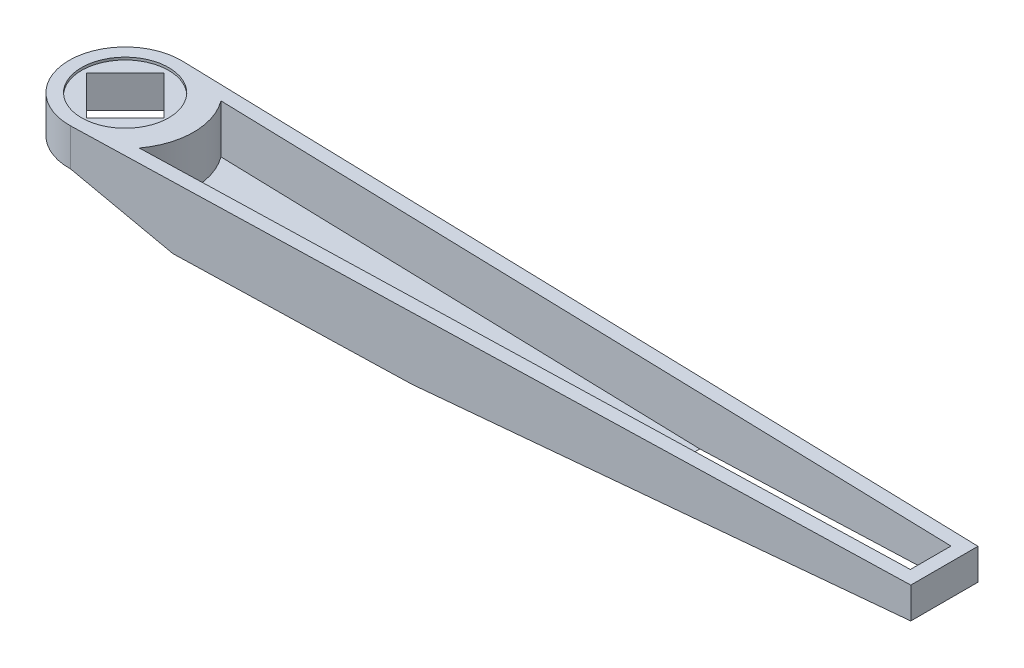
ISO-10303-21;
HEADER;
FILE_DESCRIPTION(('STEP AP214'),'2;1');
FILE_NAME('part.step','',(''),(''),'','','');
FILE_SCHEMA(('AUTOMOTIVE_DESIGN { 1 0 10303 214 1 1 1 1 }'));
ENDSEC;
DATA;
#1=APPLICATION_CONTEXT('core data for automotive mechanical design processes');
#2=APPLICATION_PROTOCOL_DEFINITION('international standard','automotive_design',2000,#1);
#3=PRODUCT_CONTEXT('',#1,'mechanical');
#4=PRODUCT('Part','Part','',(#3));
#5=PRODUCT_RELATED_PRODUCT_CATEGORY('part','',(#4));
#6=PRODUCT_DEFINITION_FORMATION('','',#4);
#7=PRODUCT_DEFINITION_CONTEXT('part definition',#1,'design');
#8=PRODUCT_DEFINITION('design','',#6,#7);
#9=PRODUCT_DEFINITION_SHAPE('','',#8);
#10=(LENGTH_UNIT() NAMED_UNIT(*) SI_UNIT(.MILLI.,.METRE.));
#11=(NAMED_UNIT(*) PLANE_ANGLE_UNIT() SI_UNIT($,.RADIAN.));
#12=(NAMED_UNIT(*) SI_UNIT($,.STERADIAN.) SOLID_ANGLE_UNIT());
#13=UNCERTAINTY_MEASURE_WITH_UNIT(LENGTH_MEASURE(1.E-05),#10,'distance_accuracy_value','');
#14=(GEOMETRIC_REPRESENTATION_CONTEXT(3) GLOBAL_UNCERTAINTY_ASSIGNED_CONTEXT((#13)) GLOBAL_UNIT_ASSIGNED_CONTEXT((#10,
#11,#12)) REPRESENTATION_CONTEXT('',''));
#15=CARTESIAN_POINT('',(0.,0.,0.));
#16=DIRECTION('',(0.,0.,1.));
#17=DIRECTION('',(1.,0.,0.));
#18=AXIS2_PLACEMENT_3D('',#15,#16,#17);
#19=CARTESIAN_POINT('',(15.556349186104,0.,0.));
#20=DIRECTION('',(0.707106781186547,0.,-0.707106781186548));
#21=DIRECTION('',(-0.707106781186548,0.,-0.707106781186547));
#22=AXIS2_PLACEMENT_3D('',#19,#20,#21);
#23=PLANE('',#22);
#24=DIRECTION('',(-0.707106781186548,0.,-0.707106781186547));
#25=VECTOR('',#24,1.);
#26=CARTESIAN_POINT('',(15.556349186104,11.,0.));
#27=LINE('',#26,#25);
#28=CARTESIAN_POINT('',(15.556349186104,11.,0.));
#29=VERTEX_POINT('',#28);
#30=CARTESIAN_POINT('',(0.,11.,-15.556349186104));
#31=VERTEX_POINT('',#30);
#32=EDGE_CURVE('E249',#29,#31,#27,.T.);
#33=ORIENTED_EDGE('',*,*,#32,.F.);
#34=DIRECTION('',(0.,1.,0.));
#35=VECTOR('',#34,1.);
#36=CARTESIAN_POINT('',(15.556349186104,0.,0.));
#37=LINE('',#36,#35);
#38=CARTESIAN_POINT('',(15.556349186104,24.,0.));
#39=VERTEX_POINT('',#38);
#40=EDGE_CURVE('E256',#29,#39,#37,.T.);
#41=ORIENTED_EDGE('',*,*,#40,.T.);
#42=DIRECTION('',(-0.707106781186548,0.,-0.707106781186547));
#43=VECTOR('',#42,1.);
#44=CARTESIAN_POINT('',(7.77817459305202,24.,-7.77817459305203));
#45=LINE('',#44,#43);
#46=CARTESIAN_POINT('',(0.,24.,-15.556349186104));
#47=VERTEX_POINT('',#46);
#48=EDGE_CURVE('E344',#39,#47,#45,.T.);
#49=ORIENTED_EDGE('',*,*,#48,.T.);
#50=DIRECTION('',(0.,1.,0.));
#51=VECTOR('',#50,1.);
#52=CARTESIAN_POINT('',(0.,0.,-15.556349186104));
#53=LINE('',#52,#51);
#54=EDGE_CURVE('E251',#31,#47,#53,.T.);
#55=ORIENTED_EDGE('',*,*,#54,.F.);
#56=EDGE_LOOP('',(#33,#41,#49,#55));
#57=FACE_BOUND('',#56,.T.);
#58=ADVANCED_FACE('F61',(#57),#23,.F.);
#59=CARTESIAN_POINT('',(0.,0.,15.556349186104));
#60=DIRECTION('',(0.707106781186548,0.,0.707106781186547));
#61=DIRECTION('',(0.707106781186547,0.,-0.707106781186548));
#62=AXIS2_PLACEMENT_3D('',#59,#60,#61);
#63=PLANE('',#62);
#64=DIRECTION('',(0.707106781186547,0.,-0.707106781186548));
#65=VECTOR('',#64,1.);
#66=CARTESIAN_POINT('',(0.,11.,15.556349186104));
#67=LINE('',#66,#65);
#68=CARTESIAN_POINT('',(0.,11.,15.556349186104));
#69=VERTEX_POINT('',#68);
#70=EDGE_CURVE('E247',#69,#29,#67,.T.);
#71=ORIENTED_EDGE('',*,*,#70,.F.);
#72=DIRECTION('',(0.,1.,0.));
#73=VECTOR('',#72,1.);
#74=CARTESIAN_POINT('',(0.,0.,15.556349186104));
#75=LINE('',#74,#73);
#76=CARTESIAN_POINT('',(0.,24.,15.556349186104));
#77=VERTEX_POINT('',#76);
#78=EDGE_CURVE('E257',#69,#77,#75,.T.);
#79=ORIENTED_EDGE('',*,*,#78,.T.);
#80=DIRECTION('',(0.707106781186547,0.,-0.707106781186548));
#81=VECTOR('',#80,1.);
#82=CARTESIAN_POINT('',(7.77817459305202,24.,7.77817459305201));
#83=LINE('',#82,#81);
#84=EDGE_CURVE('E341',#77,#39,#83,.T.);
#85=ORIENTED_EDGE('',*,*,#84,.T.);
#86=ORIENTED_EDGE('',*,*,#40,.F.);
#87=EDGE_LOOP('',(#71,#79,#85,#86));
#88=FACE_BOUND('',#87,.T.);
#89=ADVANCED_FACE('F371',(#88),#63,.F.);
#90=CARTESIAN_POINT('',(-15.556349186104,0.,0.));
#91=DIRECTION('',(-0.707106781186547,0.,0.707106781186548));
#92=DIRECTION('',(0.707106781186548,0.,0.707106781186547));
#93=AXIS2_PLACEMENT_3D('',#90,#91,#92);
#94=PLANE('',#93);
#95=DIRECTION('',(0.707106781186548,0.,0.707106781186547));
#96=VECTOR('',#95,1.);
#97=CARTESIAN_POINT('',(-15.556349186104,11.,0.));
#98=LINE('',#97,#96);
#99=CARTESIAN_POINT('',(-15.556349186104,11.,0.));
#100=VERTEX_POINT('',#99);
#101=EDGE_CURVE('E245',#100,#69,#98,.T.);
#102=ORIENTED_EDGE('',*,*,#101,.F.);
#103=DIRECTION('',(0.,1.,0.));
#104=VECTOR('',#103,1.);
#105=CARTESIAN_POINT('',(-15.556349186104,0.,0.));
#106=LINE('',#105,#104);
#107=CARTESIAN_POINT('',(-15.556349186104,24.,0.));
#108=VERTEX_POINT('',#107);
#109=EDGE_CURVE('E259',#100,#108,#106,.T.);
#110=ORIENTED_EDGE('',*,*,#109,.T.);
#111=DIRECTION('',(0.707106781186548,0.,0.707106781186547));
#112=VECTOR('',#111,1.);
#113=CARTESIAN_POINT('',(-7.77817459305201,24.,7.77817459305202));
#114=LINE('',#113,#112);
#115=EDGE_CURVE('E338',#108,#77,#114,.T.);
#116=ORIENTED_EDGE('',*,*,#115,.T.);
#117=ORIENTED_EDGE('',*,*,#78,.F.);
#118=EDGE_LOOP('',(#102,#110,#116,#117));
#119=FACE_BOUND('',#118,.T.);
#120=ADVANCED_FACE('F378',(#119),#94,.F.);
#121=CARTESIAN_POINT('',(0.,0.,-15.556349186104));
#122=DIRECTION('',(-0.707106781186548,0.,-0.707106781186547));
#123=DIRECTION('',(-0.707106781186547,0.,0.707106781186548));
#124=AXIS2_PLACEMENT_3D('',#121,#122,#123);
#125=PLANE('',#124);
#126=DIRECTION('',(-0.707106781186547,0.,0.707106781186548));
#127=VECTOR('',#126,1.);
#128=CARTESIAN_POINT('',(0.,11.,-15.556349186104));
#129=LINE('',#128,#127);
#130=EDGE_CURVE('E347',#31,#100,#129,.T.);
#131=ORIENTED_EDGE('',*,*,#130,.F.);
#132=ORIENTED_EDGE('',*,*,#54,.T.);
#133=DIRECTION('',(-0.707106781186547,0.,0.707106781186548));
#134=VECTOR('',#133,1.);
#135=CARTESIAN_POINT('',(-7.77817459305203,24.,-7.77817459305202));
#136=LINE('',#135,#134);
#137=EDGE_CURVE('E334',#47,#108,#136,.T.);
#138=ORIENTED_EDGE('',*,*,#137,.T.);
#139=ORIENTED_EDGE('',*,*,#109,.F.);
#140=EDGE_LOOP('',(#131,#132,#138,#139));
#141=FACE_BOUND('',#140,.T.);
#142=ADVANCED_FACE('F521',(#141),#125,.F.);
#143=CARTESIAN_POINT('',(0.615847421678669,25.,-22.4915702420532));
#144=DIRECTION('',(1.,0.,0.));
#145=DIRECTION('',(0.,0.,-1.));
#146=AXIS2_PLACEMENT_3D('',#143,#144,#145);
#147=PLANE('',#146);
#148=DIRECTION('',(0.,0.00684258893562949,0.999976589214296));
#149=VECTOR('',#148,1.);
#150=CARTESIAN_POINT('',(0.615847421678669,9.69290838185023,-22.3868276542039));
#151=LINE('',#150,#149);
#152=CARTESIAN_POINT('',(0.615847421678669,9.69219165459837,-22.4915702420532));
#153=VERTEX_POINT('',#152);
#154=CARTESIAN_POINT('',(0.615847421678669,9.74386172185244,-14.9405017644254));
#155=VERTEX_POINT('',#154);
#156=EDGE_CURVE('E327',#153,#155,#151,.T.);
#157=ORIENTED_EDGE('',*,*,#156,.T.);
#158=DIRECTION('',(0.,1.,0.));
#159=VECTOR('',#158,1.);
#160=CARTESIAN_POINT('',(0.615847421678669,25.,-14.9405017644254));
#161=LINE('',#160,#159);
#162=CARTESIAN_POINT('',(0.61584742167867,10.,-14.9405017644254));
#163=VERTEX_POINT('',#162);
#164=EDGE_CURVE('E267',#155,#163,#161,.T.);
#165=ORIENTED_EDGE('',*,*,#164,.T.);
#166=DIRECTION('',(0.,0.,-1.));
#167=VECTOR('',#166,1.);
#168=CARTESIAN_POINT('',(0.615847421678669,10.,-22.4915702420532));
#169=LINE('',#168,#167);
#170=CARTESIAN_POINT('',(0.615847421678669,10.,-17.4891604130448));
#171=VERTEX_POINT('',#170);
#172=EDGE_CURVE('E240',#163,#171,#169,.T.);
#173=ORIENTED_EDGE('',*,*,#172,.T.);
#174=DIRECTION('',(0.,0.,1.));
#175=VECTOR('',#174,1.);
#176=CARTESIAN_POINT('',(0.615847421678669,10.,-22.4915702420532));
#177=LINE('',#176,#175);
#178=CARTESIAN_POINT('',(0.615847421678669,10.,-22.4915702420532));
#179=VERTEX_POINT('',#178);
#180=EDGE_CURVE('E331',#179,#171,#177,.T.);
#181=ORIENTED_EDGE('',*,*,#180,.F.);
#182=DIRECTION('',(0.,-1.,0.));
#183=VECTOR('',#182,1.);
#184=CARTESIAN_POINT('',(0.615847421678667,25.,-22.4915702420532));
#185=LINE('',#184,#183);
#186=EDGE_CURVE('E318',#179,#153,#185,.T.);
#187=ORIENTED_EDGE('',*,*,#186,.T.);
#188=EDGE_LOOP('',(#157,#165,#173,#181,#187));
#189=FACE_BOUND('',#188,.T.);
#190=ADVANCED_FACE('F419',(#189),#147,.F.);
#191=CARTESIAN_POINT('',(0.615847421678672,10.,14.9405017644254));
#192=VERTEX_POINT('',#191);
#193=CARTESIAN_POINT('',(0.615847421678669,10.,17.4891604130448));
#194=VERTEX_POINT('',#193);
#195=EDGE_CURVE('E335',#192,#194,#177,.T.);
#196=ORIENTED_EDGE('',*,*,#195,.F.);
#197=DIRECTION('',(0.,-1.,0.));
#198=VECTOR('',#197,1.);
#199=CARTESIAN_POINT('',(0.615847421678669,25.,14.9405017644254));
#200=LINE('',#199,#198);
#201=CARTESIAN_POINT('',(0.615847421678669,9.94832993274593,14.9405017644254));
#202=VERTEX_POINT('',#201);
#203=EDGE_CURVE('E255',#192,#202,#200,.T.);
#204=ORIENTED_EDGE('',*,*,#203,.T.);
#205=CARTESIAN_POINT('',(0.615847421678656,10.,22.4915702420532));
#206=VERTEX_POINT('',#205);
#207=EDGE_CURVE('E326',#202,#206,#151,.T.);
#208=ORIENTED_EDGE('',*,*,#207,.T.);
#209=EDGE_CURVE('E330',#194,#206,#177,.T.);
#210=ORIENTED_EDGE('',*,*,#209,.F.);
#211=EDGE_LOOP('',(#196,#204,#208,#210));
#212=FACE_BOUND('',#211,.T.);
#213=ADVANCED_FACE('F63',(#212),#147,.F.);
#214=CARTESIAN_POINT('',(-122.525664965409,0.,0.));
#215=DIRECTION('',(0.,1.,0.));
#216=DIRECTION('',(0.,0.,1.));
#217=AXIS2_PLACEMENT_3D('',#214,#215,#216);
#218=PLANE('',#217);
#219=DIRECTION('',(0.999625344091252,0.,-0.027370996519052));
#220=VECTOR('',#219,1.);
#221=CARTESIAN_POINT('',(-121.818024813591,0.,25.8439633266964));
#222=LINE('',#221,#220);
#223=CARTESIAN_POINT('',(40.6008611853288,0.,21.3967303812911));
#224=VERTEX_POINT('',#223);
#225=CARTESIAN_POINT('',(134.,0.,18.8393447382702));
#226=VERTEX_POINT('',#225);
#227=EDGE_CURVE('E305',#224,#226,#222,.T.);
#228=ORIENTED_EDGE('',*,*,#227,.F.);
#229=DIRECTION('',(-0.027370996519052,0.,-0.999625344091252));
#230=VECTOR('',#229,1.);
#231=CARTESIAN_POINT('',(53.2618925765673,0.,483.794504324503));
#232=LINE('',#231,#230);
#233=CARTESIAN_POINT('',(39.4282433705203,0.,-21.4288381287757));
#234=VERTEX_POINT('',#233);
#235=EDGE_CURVE('E283',#224,#234,#232,.T.);
#236=ORIENTED_EDGE('',*,*,#235,.T.);
#237=DIRECTION('',(0.999625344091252,0.,0.027370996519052));
#238=VECTOR('',#237,1.);
#239=CARTESIAN_POINT('',(-121.818024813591,0.,-25.8439633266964));
#240=LINE('',#239,#238);
#241=CARTESIAN_POINT('',(134.,0.,-18.8393447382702));
#242=VERTEX_POINT('',#241);
#243=EDGE_CURVE('E300',#234,#242,#240,.T.);
#244=ORIENTED_EDGE('',*,*,#243,.T.);
#245=DIRECTION('',(0.,0.,1.));
#246=VECTOR('',#245,1.);
#247=CARTESIAN_POINT('',(134.,0.,-22.4915702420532));
#248=LINE('',#247,#246);
#249=EDGE_CURVE('E293',#242,#226,#248,.T.);
#250=ORIENTED_EDGE('',*,*,#249,.T.);
#251=EDGE_LOOP('',(#228,#236,#244,#250));
#252=FACE_BOUND('',#251,.T.);
#253=ADVANCED_FACE('F428',(#252),#218,.F.);
#254=CARTESIAN_POINT('',(-121.818024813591,25.,25.8439633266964));
#255=DIRECTION('',(-0.027370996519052,0.,-0.999625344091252));
#256=DIRECTION('',(-0.999625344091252,0.,0.027370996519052));
#257=AXIS2_PLACEMENT_3D('',#254,#255,#256);
#258=PLANE('',#257);
#259=DIRECTION('',(0.,-1.,0.));
#260=VECTOR('',#259,1.);
#261=CARTESIAN_POINT('',(0.615847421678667,25.,22.4915702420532));
#262=LINE('',#261,#260);
#263=CARTESIAN_POINT('',(0.615847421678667,25.,22.4915702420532));
#264=VERTEX_POINT('',#263);
#265=EDGE_CURVE('E315',#264,#206,#262,.T.);
#266=ORIENTED_EDGE('',*,*,#265,.T.);
#267=DIRECTION('',(0.969779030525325,-0.242535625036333,-0.0265537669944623));
#268=VECTOR('',#267,1.);
#269=CARTESIAN_POINT('',(-118.144121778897,39.7011200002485,25.7433672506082));
#270=LINE('',#269,#268);
#271=EDGE_CURVE('E289',#206,#224,#270,.T.);
#272=ORIENTED_EDGE('',*,*,#271,.T.);
#273=ORIENTED_EDGE('',*,*,#227,.T.);
#274=DIRECTION('',(0.997579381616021,0.0639473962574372,-0.027314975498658));
#275=VECTOR('',#274,1.);
#276=CARTESIAN_POINT('',(-119.177100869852,-16.229301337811,25.7716515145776));
#277=LINE('',#276,#275);
#278=CARTESIAN_POINT('',(329.,12.5,13.5));
#279=VERTEX_POINT('',#278);
#280=EDGE_CURVE('E296',#226,#279,#277,.T.);
#281=ORIENTED_EDGE('',*,*,#280,.T.);
#282=DIRECTION('',(0.,-1.,0.));
#283=VECTOR('',#282,1.);
#284=CARTESIAN_POINT('',(329.,25.,13.5));
#285=LINE('',#284,#283);
#286=CARTESIAN_POINT('',(329.,25.,13.5));
#287=VERTEX_POINT('',#286);
#288=EDGE_CURVE('E310',#287,#279,#285,.T.);
#289=ORIENTED_EDGE('',*,*,#288,.F.);
#290=DIRECTION('',(0.999625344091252,0.,-0.027370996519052));
#291=VECTOR('',#290,1.);
#292=CARTESIAN_POINT('',(-121.818024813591,25.,25.8439633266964));
#293=LINE('',#292,#291);
#294=EDGE_CURVE('E308',#264,#287,#293,.T.);
#295=ORIENTED_EDGE('',*,*,#294,.F.);
#296=EDGE_LOOP('',(#266,#272,#273,#281,#289,#295));
#297=FACE_BOUND('',#296,.T.);
#298=ADVANCED_FACE('F432',(#297),#258,.F.);
#299=CARTESIAN_POINT('',(329.,25.,0.));
#300=DIRECTION('',(1.,0.,0.));
#301=DIRECTION('',(0.,0.,-1.));
#302=AXIS2_PLACEMENT_3D('',#299,#300,#301);
#303=PLANE('',#302);
#304=DIRECTION('',(0.,0.,1.));
#305=VECTOR('',#304,1.);
#306=CARTESIAN_POINT('',(329.,12.5,-22.4915702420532));
#307=LINE('',#306,#305);
#308=CARTESIAN_POINT('',(329.,12.5,-13.5));
#309=VERTEX_POINT('',#308);
#310=EDGE_CURVE('E292',#309,#279,#307,.T.);
#311=ORIENTED_EDGE('',*,*,#310,.F.);
#312=DIRECTION('',(0.,-1.,0.));
#313=VECTOR('',#312,1.);
#314=CARTESIAN_POINT('',(329.,25.,-13.5));
#315=LINE('',#314,#313);
#316=CARTESIAN_POINT('',(329.,25.,-13.5));
#317=VERTEX_POINT('',#316);
#318=EDGE_CURVE('E321',#317,#309,#315,.T.);
#319=ORIENTED_EDGE('',*,*,#318,.F.);
#320=DIRECTION('',(0.,0.,1.));
#321=VECTOR('',#320,1.);
#322=CARTESIAN_POINT('',(329.,25.,0.));
#323=LINE('',#322,#321);
#324=EDGE_CURVE('E301',#317,#287,#323,.T.);
#325=ORIENTED_EDGE('',*,*,#324,.T.);
#326=ORIENTED_EDGE('',*,*,#288,.T.);
#327=EDGE_LOOP('',(#311,#319,#325,#326));
#328=FACE_BOUND('',#327,.T.);
#329=ADVANCED_FACE('F436',(#328),#303,.T.);
#330=CARTESIAN_POINT('',(-121.818024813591,25.,-25.8439633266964));
#331=DIRECTION('',(0.027370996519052,0.,-0.999625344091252));
#332=DIRECTION('',(-0.999625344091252,0.,-0.027370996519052));
#333=AXIS2_PLACEMENT_3D('',#330,#331,#332);
#334=PLANE('',#333);
#335=DIRECTION('',(0.969864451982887,-0.242193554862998,0.02655610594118));
#336=VECTOR('',#335,1.);
#337=CARTESIAN_POINT('',(-118.23205966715,39.3707689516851,-25.7457751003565));
#338=LINE('',#337,#336);
#339=EDGE_CURVE('E287',#153,#234,#338,.T.);
#340=ORIENTED_EDGE('',*,*,#339,.F.);
#341=ORIENTED_EDGE('',*,*,#186,.F.);
#342=CARTESIAN_POINT('',(0.615847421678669,25.,-22.4915702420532));
#343=VERTEX_POINT('',#342);
#344=EDGE_CURVE('E319',#343,#179,#185,.T.);
#345=ORIENTED_EDGE('',*,*,#344,.F.);
#346=DIRECTION('',(0.999625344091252,0.,0.027370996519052));
#347=VECTOR('',#346,1.);
#348=CARTESIAN_POINT('',(-121.818024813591,25.,-25.8439633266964));
#349=LINE('',#348,#347);
#350=EDGE_CURVE('E304',#343,#317,#349,.T.);
#351=ORIENTED_EDGE('',*,*,#350,.T.);
#352=ORIENTED_EDGE('',*,*,#318,.T.);
#353=DIRECTION('',(0.997579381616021,0.0639473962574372,0.027314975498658));
#354=VECTOR('',#353,1.);
#355=CARTESIAN_POINT('',(-119.177100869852,-16.229301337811,-25.7716515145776));
#356=LINE('',#355,#354);
#357=EDGE_CURVE('E324',#242,#309,#356,.T.);
#358=ORIENTED_EDGE('',*,*,#357,.F.);
#359=ORIENTED_EDGE('',*,*,#243,.F.);
#360=EDGE_LOOP('',(#340,#341,#345,#351,#352,#358,#359));
#361=FACE_BOUND('',#360,.T.);
#362=ADVANCED_FACE('F422',(#361),#334,.T.);
#363=CARTESIAN_POINT('',(-122.525664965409,25.,0.));
#364=DIRECTION('',(0.,1.,0.));
#365=DIRECTION('',(0.,0.,1.));
#366=AXIS2_PLACEMENT_3D('',#363,#364,#365);
#367=PLANE('',#366);
#368=CARTESIAN_POINT('',(0.,25.,0.));
#369=DIRECTION('',(0.,-1.,0.));
#370=DIRECTION('',(0.,0.,1.));
#371=AXIS2_PLACEMENT_3D('',#368,#369,#370);
#372=CIRCLE('',#371,27.5);
#373=CARTESIAN_POINT('',(22.0731747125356,25.,-16.4019803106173));
#374=VERTEX_POINT('',#373);
#375=CARTESIAN_POINT('',(22.0731747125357,25.,16.4019803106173));
#376=VERTEX_POINT('',#375);
#377=EDGE_CURVE('E76',#374,#376,#372,.T.);
#378=ORIENTED_EDGE('',*,*,#377,.F.);
#379=DIRECTION('',(-0.999625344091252,0.,-0.027370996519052));
#380=VECTOR('',#379,1.);
#381=CARTESIAN_POINT('',(22.0731747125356,25.,-16.4019803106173));
#382=LINE('',#381,#380);
#383=CARTESIAN_POINT('',(323.5,25.,-8.14853552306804));
#384=VERTEX_POINT('',#383);
#385=EDGE_CURVE('E217',#384,#374,#382,.T.);
#386=ORIENTED_EDGE('',*,*,#385,.F.);
#387=DIRECTION('',(0.,0.,-1.));
#388=VECTOR('',#387,1.);
#389=CARTESIAN_POINT('',(323.5,25.,-8.14853552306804));
#390=LINE('',#389,#388);
#391=CARTESIAN_POINT('',(323.5,25.,8.14853552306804));
#392=VERTEX_POINT('',#391);
#393=EDGE_CURVE('E201',#392,#384,#390,.T.);
#394=ORIENTED_EDGE('',*,*,#393,.F.);
#395=DIRECTION('',(0.999625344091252,0.,-0.027370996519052));
#396=VECTOR('',#395,1.);
#397=CARTESIAN_POINT('',(22.0731747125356,25.,16.4019803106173));
#398=LINE('',#397,#396);
#399=EDGE_CURVE('E210',#376,#392,#398,.T.);
#400=ORIENTED_EDGE('',*,*,#399,.F.);
#401=EDGE_LOOP('',(#378,#386,#394,#400));
#402=FACE_BOUND('',#401,.T.);
#403=CARTESIAN_POINT('',(0.,25.,0.));
#404=DIRECTION('',(0.,1.,0.));
#405=DIRECTION('',(0.,0.,1.));
#406=AXIS2_PLACEMENT_3D('',#403,#404,#405);
#407=CIRCLE('',#406,17.5);
#408=CARTESIAN_POINT('',(0.,25.,17.5));
#409=VERTEX_POINT('',#408);
#410=EDGE_CURVE('E273',#409,#409,#407,.T.);
#411=ORIENTED_EDGE('',*,*,#410,.F.);
#412=EDGE_LOOP('',(#411));
#413=FACE_BOUND('',#412,.T.);
#414=ORIENTED_EDGE('',*,*,#350,.F.);
#415=CARTESIAN_POINT('',(0.,25.,0.));
#416=DIRECTION('',(0.,1.,0.));
#417=DIRECTION('',(0.,0.,1.));
#418=AXIS2_PLACEMENT_3D('',#415,#416,#417);
#419=CIRCLE('',#418,22.5);
#420=EDGE_CURVE('E277',#343,#264,#419,.T.);
#421=ORIENTED_EDGE('',*,*,#420,.T.);
#422=ORIENTED_EDGE('',*,*,#294,.T.);
#423=ORIENTED_EDGE('',*,*,#324,.F.);
#424=EDGE_LOOP('',(#414,#421,#422,#423));
#425=FACE_BOUND('',#424,.T.);
#426=ADVANCED_FACE('F214',(#402,#413,#425),#367,.T.);
#427=CARTESIAN_POINT('',(329.,12.5,-22.4915702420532));
#428=DIRECTION('',(-0.063971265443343,0.997951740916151,0.));
#429=DIRECTION('',(-0.997951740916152,-0.063971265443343,0.));
#430=AXIS2_PLACEMENT_3D('',#427,#428,#429);
#431=PLANE('',#430);
#432=DIRECTION('',(0.,0.,-1.));
#433=VECTOR('',#432,1.);
#434=CARTESIAN_POINT('',(323.5,12.1474358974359,-22.4915702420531));
#435=LINE('',#434,#433);
#436=CARTESIAN_POINT('',(323.5,12.1474358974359,8.14853552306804));
#437=VERTEX_POINT('',#436);
#438=CARTESIAN_POINT('',(323.5,12.1474358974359,-8.14853552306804));
#439=VERTEX_POINT('',#438);
#440=EDGE_CURVE('E69',#437,#439,#435,.T.);
#441=ORIENTED_EDGE('',*,*,#440,.T.);
#442=DIRECTION('',(-0.997579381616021,-0.0639473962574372,-0.027314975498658));
#443=VECTOR('',#442,1.);
#444=CARTESIAN_POINT('',(328.605065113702,12.4746836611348,-8.00875243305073));
#445=LINE('',#444,#443);
#446=CARTESIAN_POINT('',(219.8,5.5,-10.9879716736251));
#447=VERTEX_POINT('',#446);
#448=EDGE_CURVE('E13',#439,#447,#445,.T.);
#449=ORIENTED_EDGE('',*,*,#448,.T.);
#450=DIRECTION('',(0.,0.,-1.));
#451=VECTOR('',#450,1.);
#452=CARTESIAN_POINT('',(219.8,5.5,-22.4915702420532));
#453=LINE('',#452,#451);
#454=CARTESIAN_POINT('',(219.8,5.5,10.987971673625));
#455=VERTEX_POINT('',#454);
#456=EDGE_CURVE('E349',#455,#447,#453,.T.);
#457=ORIENTED_EDGE('',*,*,#456,.F.);
#458=DIRECTION('',(0.997579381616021,0.0639473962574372,-0.027314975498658));
#459=VECTOR('',#458,1.);
#460=CARTESIAN_POINT('',(329.830804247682,12.5532566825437,7.97519015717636));
#461=LINE('',#460,#459);
#462=EDGE_CURVE('E351',#455,#437,#461,.T.);
#463=ORIENTED_EDGE('',*,*,#462,.T.);
#464=EDGE_LOOP('',(#441,#449,#457,#463));
#465=FACE_BOUND('',#464,.T.);
#466=ORIENTED_EDGE('',*,*,#249,.F.);
#467=ORIENTED_EDGE('',*,*,#357,.T.);
#468=ORIENTED_EDGE('',*,*,#310,.T.);
#469=ORIENTED_EDGE('',*,*,#280,.F.);
#470=EDGE_LOOP('',(#466,#467,#468,#469));
#471=FACE_BOUND('',#470,.T.);
#472=ADVANCED_FACE('F353',(#465,#471),#431,.F.);
#473=CARTESIAN_POINT('',(13.2768788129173,10.,484.889344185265));
#474=DIRECTION('',(0.242444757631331,0.970142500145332,-0.00663844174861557));
#475=DIRECTION('',(-0.970163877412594,0.242450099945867,0.));
#476=AXIS2_PLACEMENT_3D('',#473,#474,#475);
#477=PLANE('',#476);
#478=DIRECTION('',(0.695734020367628,-0.178629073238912,-0.695734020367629));
#479=VECTOR('',#478,1.);
#480=CARTESIAN_POINT('',(-220.738830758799,66.7809410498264,236.295179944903));
#481=LINE('',#480,#479);
#482=CARTESIAN_POINT('',(15.556349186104,6.11236977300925,0.));
#483=VERTEX_POINT('',#482);
#484=EDGE_CURVE('E264',#202,#483,#481,.T.);
#485=ORIENTED_EDGE('',*,*,#484,.T.);
#486=DIRECTION('',(-0.696888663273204,0.169388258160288,-0.696888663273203));
#487=VECTOR('',#486,1.);
#488=CARTESIAN_POINT('',(249.47875829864,-50.7456500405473,233.922409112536));
#489=LINE('',#488,#487);
#490=EDGE_CURVE('E270',#483,#155,#489,.T.);
#491=ORIENTED_EDGE('',*,*,#490,.T.);
#492=ORIENTED_EDGE('',*,*,#156,.F.);
#493=ORIENTED_EDGE('',*,*,#339,.T.);
#494=ORIENTED_EDGE('',*,*,#235,.F.);
#495=ORIENTED_EDGE('',*,*,#271,.F.);
#496=ORIENTED_EDGE('',*,*,#207,.F.);
#497=EDGE_LOOP('',(#485,#491,#492,#493,#494,#495,#496));
#498=FACE_BOUND('',#497,.T.);
#499=ADVANCED_FACE('F400',(#498),#477,.F.);
#500=CARTESIAN_POINT('',(0.,10.,0.));
#501=DIRECTION('',(0.,1.,0.));
#502=DIRECTION('',(0.,0.,1.));
#503=AXIS2_PLACEMENT_3D('',#500,#501,#502);
#504=PLANE('',#503);
#505=ORIENTED_EDGE('',*,*,#180,.T.);
#506=CARTESIAN_POINT('',(0.,10.,0.));
#507=DIRECTION('',(0.,-1.,0.));
#508=DIRECTION('',(0.,0.,-1.));
#509=AXIS2_PLACEMENT_3D('',#506,#507,#508);
#510=CIRCLE('',#509,17.5);
#511=EDGE_CURVE('E228',#194,#171,#510,.T.);
#512=ORIENTED_EDGE('',*,*,#511,.F.);
#513=ORIENTED_EDGE('',*,*,#209,.T.);
#514=CARTESIAN_POINT('',(0.,10.,0.));
#515=DIRECTION('',(0.,1.,0.));
#516=DIRECTION('',(0.,0.,1.));
#517=AXIS2_PLACEMENT_3D('',#514,#515,#516);
#518=CIRCLE('',#517,22.5);
#519=EDGE_CURVE('E280',#179,#206,#518,.T.);
#520=ORIENTED_EDGE('',*,*,#519,.F.);
#521=EDGE_LOOP('',(#505,#512,#513,#520));
#522=FACE_BOUND('',#521,.T.);
#523=ADVANCED_FACE('F415',(#522),#504,.F.);
#524=CARTESIAN_POINT('',(0.,10.,0.));
#525=DIRECTION('',(0.,1.,0.));
#526=DIRECTION('',(0.,0.,1.));
#527=AXIS2_PLACEMENT_3D('',#524,#525,#526);
#528=CYLINDRICAL_SURFACE('',#527,22.5);
#529=ORIENTED_EDGE('',*,*,#344,.T.);
#530=ORIENTED_EDGE('',*,*,#519,.T.);
#531=ORIENTED_EDGE('',*,*,#265,.F.);
#532=ORIENTED_EDGE('',*,*,#420,.F.);
#533=EDGE_LOOP('',(#529,#530,#531,#532));
#534=FACE_BOUND('',#533,.T.);
#535=ADVANCED_FACE('F410',(#534),#528,.T.);
#536=CARTESIAN_POINT('',(0.,24.,0.));
#537=DIRECTION('',(0.,1.,0.));
#538=DIRECTION('',(0.,0.,1.));
#539=AXIS2_PLACEMENT_3D('',#536,#537,#538);
#540=CYLINDRICAL_SURFACE('',#539,17.5);
#541=CARTESIAN_POINT('',(0.,24.,0.));
#542=DIRECTION('',(0.,1.,0.));
#543=DIRECTION('',(0.,0.,1.));
#544=AXIS2_PLACEMENT_3D('',#541,#542,#543);
#545=CIRCLE('',#544,17.5);
#546=CARTESIAN_POINT('',(0.,24.,17.5));
#547=VERTEX_POINT('',#546);
#548=EDGE_CURVE('E274',#547,#547,#545,.T.);
#549=ORIENTED_EDGE('',*,*,#548,.F.);
#550=EDGE_LOOP('',(#549));
#551=FACE_BOUND('',#550,.T.);
#552=ORIENTED_EDGE('',*,*,#410,.T.);
#553=EDGE_LOOP('',(#552));
#554=FACE_BOUND('',#553,.T.);
#555=ADVANCED_FACE('F394',(#551,#554),#540,.F.);
#556=CARTESIAN_POINT('',(0.,24.,0.));
#557=DIRECTION('',(0.,1.,0.));
#558=DIRECTION('',(0.,0.,1.));
#559=AXIS2_PLACEMENT_3D('',#556,#557,#558);
#560=PLANE('',#559);
#561=ORIENTED_EDGE('',*,*,#48,.F.);
#562=ORIENTED_EDGE('',*,*,#84,.F.);
#563=ORIENTED_EDGE('',*,*,#115,.F.);
#564=ORIENTED_EDGE('',*,*,#137,.F.);
#565=EDGE_LOOP('',(#561,#562,#563,#564));
#566=FACE_BOUND('',#565,.T.);
#567=ORIENTED_EDGE('',*,*,#548,.T.);
#568=EDGE_LOOP('',(#567));
#569=FACE_BOUND('',#568,.T.);
#570=ADVANCED_FACE('F386',(#566,#569),#560,.T.);
#571=CARTESIAN_POINT('',(15.556349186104,10.,0.));
#572=VERTEX_POINT('',#571);
#573=EDGE_CURVE('E252',#483,#572,#37,.T.);
#574=ORIENTED_EDGE('',*,*,#573,.T.);
#575=DIRECTION('',(-0.707106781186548,0.,-0.707106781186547));
#576=VECTOR('',#575,1.);
#577=CARTESIAN_POINT('',(15.556349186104,10.,0.));
#578=LINE('',#577,#576);
#579=EDGE_CURVE('E233',#572,#163,#578,.T.);
#580=ORIENTED_EDGE('',*,*,#579,.T.);
#581=ORIENTED_EDGE('',*,*,#164,.F.);
#582=ORIENTED_EDGE('',*,*,#490,.F.);
#583=EDGE_LOOP('',(#574,#580,#581,#582));
#584=FACE_BOUND('',#583,.T.);
#585=ADVANCED_FACE('F374',(#584),#23,.F.);
#586=ORIENTED_EDGE('',*,*,#203,.F.);
#587=DIRECTION('',(0.707106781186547,0.,-0.707106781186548));
#588=VECTOR('',#587,1.);
#589=CARTESIAN_POINT('',(0.,10.,15.556349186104));
#590=LINE('',#589,#588);
#591=EDGE_CURVE('E237',#192,#572,#590,.T.);
#592=ORIENTED_EDGE('',*,*,#591,.T.);
#593=ORIENTED_EDGE('',*,*,#573,.F.);
#594=ORIENTED_EDGE('',*,*,#484,.F.);
#595=EDGE_LOOP('',(#586,#592,#593,#594));
#596=FACE_BOUND('',#595,.T.);
#597=ADVANCED_FACE('F381',(#596),#63,.F.);
#598=CARTESIAN_POINT('',(0.,11.,0.));
#599=DIRECTION('',(0.,-1.,0.));
#600=DIRECTION('',(0.,0.,-1.));
#601=AXIS2_PLACEMENT_3D('',#598,#599,#600);
#602=PLANE('',#601);
#603=CARTESIAN_POINT('',(0.,11.,0.));
#604=DIRECTION('',(0.,-1.,0.));
#605=DIRECTION('',(0.,0.,-1.));
#606=AXIS2_PLACEMENT_3D('',#603,#604,#605);
#607=CIRCLE('',#606,17.5);
#608=CARTESIAN_POINT('',(0.,11.,-17.5));
#609=VERTEX_POINT('',#608);
#610=EDGE_CURVE('E230',#609,#609,#607,.T.);
#611=ORIENTED_EDGE('',*,*,#610,.T.);
#612=EDGE_LOOP('',(#611));
#613=FACE_BOUND('',#612,.T.);
#614=ORIENTED_EDGE('',*,*,#32,.T.);
#615=ORIENTED_EDGE('',*,*,#130,.T.);
#616=ORIENTED_EDGE('',*,*,#101,.T.);
#617=ORIENTED_EDGE('',*,*,#70,.T.);
#618=EDGE_LOOP('',(#614,#615,#616,#617));
#619=FACE_BOUND('',#618,.T.);
#620=ADVANCED_FACE('F392',(#613,#619),#602,.T.);
#621=CARTESIAN_POINT('',(0.,10.,0.));
#622=DIRECTION('',(0.,-1.,0.));
#623=DIRECTION('',(0.,0.,-1.));
#624=AXIS2_PLACEMENT_3D('',#621,#622,#623);
#625=PLANE('',#624);
#626=ORIENTED_EDGE('',*,*,#579,.F.);
#627=ORIENTED_EDGE('',*,*,#591,.F.);
#628=ORIENTED_EDGE('',*,*,#195,.T.);
#629=EDGE_CURVE('E234',#171,#194,#510,.T.);
#630=ORIENTED_EDGE('',*,*,#629,.F.);
#631=ORIENTED_EDGE('',*,*,#172,.F.);
#632=EDGE_LOOP('',(#626,#627,#628,#630,#631));
#633=FACE_BOUND('',#632,.T.);
#634=ADVANCED_FACE('F567',(#633),#625,.F.);
#635=CARTESIAN_POINT('',(0.,11.,0.));
#636=DIRECTION('',(0.,-1.,0.));
#637=DIRECTION('',(0.,0.,-1.));
#638=AXIS2_PLACEMENT_3D('',#635,#636,#637);
#639=CYLINDRICAL_SURFACE('',#638,17.5);
#640=ORIENTED_EDGE('',*,*,#610,.F.);
#641=EDGE_LOOP('',(#640));
#642=FACE_BOUND('',#641,.T.);
#643=ORIENTED_EDGE('',*,*,#629,.T.);
#644=ORIENTED_EDGE('',*,*,#511,.T.);
#645=EDGE_LOOP('',(#643,#644));
#646=FACE_BOUND('',#645,.T.);
#647=ADVANCED_FACE('F576',(#642,#646),#639,.F.);
#648=CARTESIAN_POINT('',(22.0731747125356,-303.206581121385,-16.4019803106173));
#649=DIRECTION('',(0.027370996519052,0.,-0.999625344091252));
#650=DIRECTION('',(-0.999625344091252,0.,-0.027370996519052));
#651=AXIS2_PLACEMENT_3D('',#648,#649,#650);
#652=PLANE('',#651);
#653=DIRECTION('',(0.,1.,0.));
#654=VECTOR('',#653,1.);
#655=CARTESIAN_POINT('',(323.5,-303.206581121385,-8.14853552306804));
#656=LINE('',#655,#654);
#657=EDGE_CURVE('E206',#439,#384,#656,.T.);
#658=ORIENTED_EDGE('',*,*,#657,.T.);
#659=ORIENTED_EDGE('',*,*,#385,.T.);
#660=DIRECTION('',(0.,1.,0.));
#661=VECTOR('',#660,1.);
#662=CARTESIAN_POINT('',(22.0731747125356,-303.206581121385,-16.4019803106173));
#663=LINE('',#662,#661);
#664=CARTESIAN_POINT('',(22.0731747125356,5.50000000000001,-16.4019803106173));
#665=VERTEX_POINT('',#664);
#666=EDGE_CURVE('E222',#665,#374,#663,.T.);
#667=ORIENTED_EDGE('',*,*,#666,.F.);
#668=DIRECTION('',(0.999625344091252,0.,0.027370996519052));
#669=VECTOR('',#668,1.);
#670=CARTESIAN_POINT('',(22.0731747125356,5.50000000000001,-16.4019803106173));
#671=LINE('',#670,#669);
#672=EDGE_CURVE('E224',#665,#447,#671,.T.);
#673=ORIENTED_EDGE('',*,*,#672,.T.);
#674=ORIENTED_EDGE('',*,*,#448,.F.);
#675=EDGE_LOOP('',(#658,#659,#667,#673,#674));
#676=FACE_BOUND('',#675,.T.);
#677=ADVANCED_FACE('F585',(#676),#652,.F.);
#678=CARTESIAN_POINT('',(323.5,-303.206581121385,-8.14853552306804));
#679=DIRECTION('',(1.,0.,0.));
#680=DIRECTION('',(0.,0.,-1.));
#681=AXIS2_PLACEMENT_3D('',#678,#679,#680);
#682=PLANE('',#681);
#683=DIRECTION('',(0.,1.,0.));
#684=VECTOR('',#683,1.);
#685=CARTESIAN_POINT('',(323.5,-303.206581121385,8.14853552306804));
#686=LINE('',#685,#684);
#687=EDGE_CURVE('E196',#437,#392,#686,.T.);
#688=ORIENTED_EDGE('',*,*,#687,.T.);
#689=ORIENTED_EDGE('',*,*,#393,.T.);
#690=ORIENTED_EDGE('',*,*,#657,.F.);
#691=ORIENTED_EDGE('',*,*,#440,.F.);
#692=EDGE_LOOP('',(#688,#689,#690,#691));
#693=FACE_BOUND('',#692,.T.);
#694=ADVANCED_FACE('F198',(#693),#682,.F.);
#695=CARTESIAN_POINT('',(22.0731747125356,-303.206581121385,16.4019803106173));
#696=DIRECTION('',(0.027370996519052,0.,0.999625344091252));
#697=DIRECTION('',(0.999625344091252,0.,-0.027370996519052));
#698=AXIS2_PLACEMENT_3D('',#695,#696,#697);
#699=PLANE('',#698);
#700=DIRECTION('',(-0.999625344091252,0.,0.027370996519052));
#701=VECTOR('',#700,1.);
#702=CARTESIAN_POINT('',(22.0731747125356,5.50000000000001,16.4019803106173));
#703=LINE('',#702,#701);
#704=CARTESIAN_POINT('',(22.0731747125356,5.50000000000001,16.4019803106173));
#705=VERTEX_POINT('',#704);
#706=EDGE_CURVE('E84',#455,#705,#703,.T.);
#707=ORIENTED_EDGE('',*,*,#706,.T.);
#708=DIRECTION('',(0.,1.,0.));
#709=VECTOR('',#708,1.);
#710=CARTESIAN_POINT('',(22.0731747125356,-303.206581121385,16.4019803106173));
#711=LINE('',#710,#709);
#712=EDGE_CURVE('E207',#705,#376,#711,.T.);
#713=ORIENTED_EDGE('',*,*,#712,.T.);
#714=ORIENTED_EDGE('',*,*,#399,.T.);
#715=ORIENTED_EDGE('',*,*,#687,.F.);
#716=ORIENTED_EDGE('',*,*,#462,.F.);
#717=EDGE_LOOP('',(#707,#713,#714,#715,#716));
#718=FACE_BOUND('',#717,.T.);
#719=ADVANCED_FACE('F211',(#718),#699,.F.);
#720=CARTESIAN_POINT('',(-122.525664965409,5.5,0.));
#721=DIRECTION('',(0.,1.,0.));
#722=DIRECTION('',(0.,0.,1.));
#723=AXIS2_PLACEMENT_3D('',#720,#721,#722);
#724=PLANE('',#723);
#725=ORIENTED_EDGE('',*,*,#456,.T.);
#726=ORIENTED_EDGE('',*,*,#672,.F.);
#727=CARTESIAN_POINT('',(0.,5.50000000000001,0.));
#728=DIRECTION('',(0.,1.,0.));
#729=DIRECTION('',(0.,0.,1.));
#730=AXIS2_PLACEMENT_3D('',#727,#728,#729);
#731=CIRCLE('',#730,27.5);
#732=EDGE_CURVE('E229',#705,#665,#731,.T.);
#733=ORIENTED_EDGE('',*,*,#732,.F.);
#734=ORIENTED_EDGE('',*,*,#706,.F.);
#735=EDGE_LOOP('',(#725,#726,#733,#734));
#736=FACE_BOUND('',#735,.T.);
#737=ADVANCED_FACE('F357',(#736),#724,.T.);
#738=CARTESIAN_POINT('',(0.,-303.206581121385,0.));
#739=DIRECTION('',(0.,1.,0.));
#740=DIRECTION('',(0.,0.,1.));
#741=AXIS2_PLACEMENT_3D('',#738,#739,#740);
#742=CYLINDRICAL_SURFACE('',#741,27.5);
#743=ORIENTED_EDGE('',*,*,#732,.T.);
#744=ORIENTED_EDGE('',*,*,#666,.T.);
#745=ORIENTED_EDGE('',*,*,#377,.T.);
#746=ORIENTED_EDGE('',*,*,#712,.F.);
#747=EDGE_LOOP('',(#743,#744,#745,#746));
#748=FACE_BOUND('',#747,.T.);
#749=ADVANCED_FACE('F361',(#748),#742,.T.);
#750=CLOSED_SHELL('',(#58,#89,#120,#142,#190,#213,#253,#298,#329,#362,#426,#472,#499,#523,#535,
#555,#570,#585,#597,#620,#634,#647,#677,#694,#719,#737,#749));
#751=MANIFOLD_SOLID_BREP('B2',#750);
#752=ADVANCED_BREP_SHAPE_REPRESENTATION('',(#18,#751),#14);
#753=SHAPE_DEFINITION_REPRESENTATION(#9,#752);
ENDSEC;
END-ISO-10303-21;
